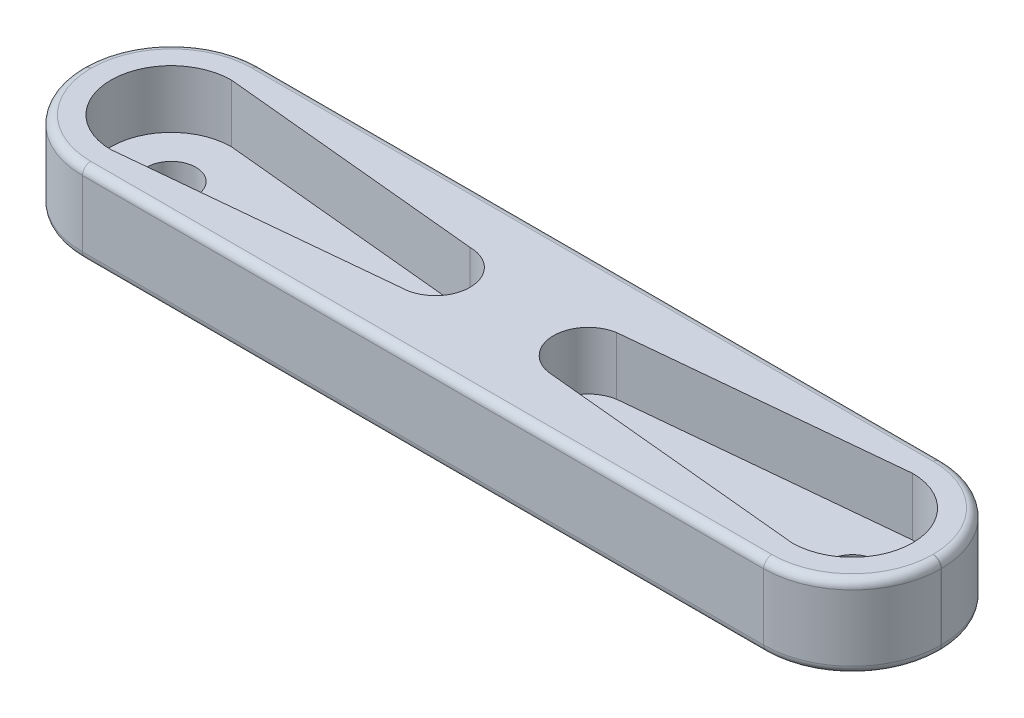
from build123d import *

# Parameters (mm, degrees)
SKETCH1_W           = 52
SKETCH1_H           = 10.77
BOSS_EXTRUDE1_DEPTH = 5
SKETCH2_R           = 1.5
CUT_EXTRUDE1_DEPTH  = 3.5
CUT_EXTRUDE2_DEPTH  = 3.5
CUT_EXTRUDE3_DEPTH  = 28.018479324
SKETCH4_R           = 1.5
CUT_EXTRUDE4_DEPTH  = 28.018479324
FILLET2_R           = 0.5


with BuildPart() as part:
    # Sketch1 → Boss-Extrude1 (new body)
    with BuildSketch(Plane(origin=(0, 0, 0), x_dir=(1, 0, 0), z_dir=(0, 1, 0))):
        Rectangle(SKETCH1_W, SKETCH1_H)
    extrude(amount=BOSS_EXTRUDE1_DEPTH)

    # Sketch2 → Cut-Extrude1 (cut)
    # profile 1 of 2: a face of its own
    with BuildSketch(Plane(origin=(0, 5, 0), x_dir=(1, 0, 0), z_dir=(0, 1, 0))):
        with BuildLine():
            ThreePointArc((-19.929387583, -3.597128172), (-17.812222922, -2.335050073), (-16.98, -0.015))
            ThreePointArc((-16.98, -0.015), (-17.812222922, 2.305050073), (-19.929387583, 3.567128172))
            Line((-19.929387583, 3.567128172), (-20.63, 3.635))
            ThreePointArc((-20.63, 3.635), (-24.28, -0.015), (-20.63, -3.665))
            Line((-20.63, -3.665), (-19.929387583, -3.597128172))
        make_face()
        with Locations(Location((-20.63, -0.015, 0), (0, 0, 270))):
            Circle(SKETCH2_R, mode=Mode.SUBTRACT)
    # profile 2 of 2: a face of its own
    with BuildSketch(Plane(origin=(0, 5, 0), x_dir=(1, 0, 0), z_dir=(0, 1, 0))):
        with BuildLine():
            ThreePointArc((19.931296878, 3.567501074), (17.81284129, 2.305800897), (16.98, -0.015))
            ThreePointArc((16.98, -0.015), (17.81284129, -2.335800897), (19.931296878, -3.597501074))
            Line((19.931296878, -3.597501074), (20.63, -3.665))
            ThreePointArc((20.63, -3.665), (24.28, -0.015), (20.63, 3.635))
            Line((20.63, 3.635), (19.931296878, 3.567501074))
        make_face()
        with Locations(Location((20.63, -0.015, 0), (0, 0, 270))):
            Circle(SKETCH2_R, mode=Mode.SUBTRACT)
    extrude(amount=-CUT_EXTRUDE1_DEPTH, mode=Mode.SUBTRACT)

    # Sketch2_3 → Cut-Extrude2 (cut)
    with BuildSketch(Plane(origin=(0, 5, 0), x_dir=(1, 0, 0), z_dir=(0, 1, 0))):
        with BuildLine():
            ThreePointArc((-19.929387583, 3.567128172), (-16.98, -0.015), (-19.929387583, -3.597128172))
            Line((-19.929387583, -3.597128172), (-4.63, -2.115))
            ThreePointArc((-4.63, -2.115), (-2.53, -0.015), (-4.63, 2.085))
            Line((-4.63, 2.085), (-19.929387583, 3.567128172))
        make_face()
        with BuildLine():
            ThreePointArc((19.931296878, -3.597501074), (16.98, -0.015), (19.931296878, 3.567501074))
            Line((19.931296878, 3.567501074), (4.278130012, 2.05531097))
            ThreePointArc((4.278130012, 2.05531097), (2.53, -0.015), (4.278130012, -2.08531097))
            Line((4.278130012, -2.08531097), (19.931296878, -3.597501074))
        make_face()
    extrude(amount=-CUT_EXTRUDE2_DEPTH, mode=Mode.SUBTRACT)

    # Sketch2_4 → Cut-Extrude3 (cut, through all)
    with BuildSketch(Plane(origin=(0, 5, 0), x_dir=(1, 0, 0), z_dir=(0, 1, 0))):
        with BuildLine():
            Line((-26, 5.385), (-26, 0.015))
            ThreePointArc((-26, 0.015), (-24.427163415, 3.812163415), (-20.63, 5.385))
            Line((-20.63, 5.385), (-26, 5.385))
        make_face()
        with BuildLine():
            Line((-26, -5.385), (-20.63, -5.385))
            ThreePointArc((-20.63, -5.385), (-24.427163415, -3.812163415), (-26, -0.015))
            Line((-26, -0.015), (-26, -5.385))
        make_face()
        with BuildLine():
            ThreePointArc((26, -0.015), (24.427163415, -3.812163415), (20.63, -5.385))
            Line((20.63, -5.385), (26, -5.385))
            Line((26, -5.385), (26, -0.015))
        make_face()
        with BuildLine():
            ThreePointArc((20.63, 5.385), (24.427163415, 3.812163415), (26, 0.015))
            Line((26, 0.015), (26, 5.385))
            Line((26, 5.385), (20.63, 5.385))
        make_face()
    extrude(amount=-CUT_EXTRUDE3_DEPTH, mode=Mode.SUBTRACT)

    # Sketch4 → Cut-Extrude4 (cut, through all)
    with BuildSketch(Plane(origin=(0, 5, 0), x_dir=(1, 0, 0), z_dir=(0, 1, 0))):
        with Locations(Location((-20.63, -0.015, 0), (0, 0, 270))):
            Circle(SKETCH4_R)
        with Locations(Location((20.63, -0.015, 0), (0, 0, 270))):
            Circle(SKETCH4_R)
    extrude(amount=-CUT_EXTRUDE4_DEPTH, mode=Mode.SUBTRACT)

    # Fillet2
    fillet2_edges = [part.edges().sort_by_distance(p)[0] for p in [
        (26, 0, 0),
        (0, 0, 5.385),
        (-26, 0, 0),
        (0, 0, -5.385),
        (0, 5, 5.385),
        (-26, 5, 0),
        (0, 5, -5.385),
        (26, 5, 0),
        (24.427163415, 5, -3.812163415),
        (24.427163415, 0, -3.812163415),
        (24.427163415, 0, 3.812163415),
        (24.427163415, 5, 3.812163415),
        (-24.427163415, 5, 3.812163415),
        (-24.427163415, 0, 3.812163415),
        (-24.427163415, 5, -3.812163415),
        (-24.427163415, 0, -3.812163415),
    ]]
    fillet(fillet2_edges, radius=FILLET2_R)


solid = part.part
